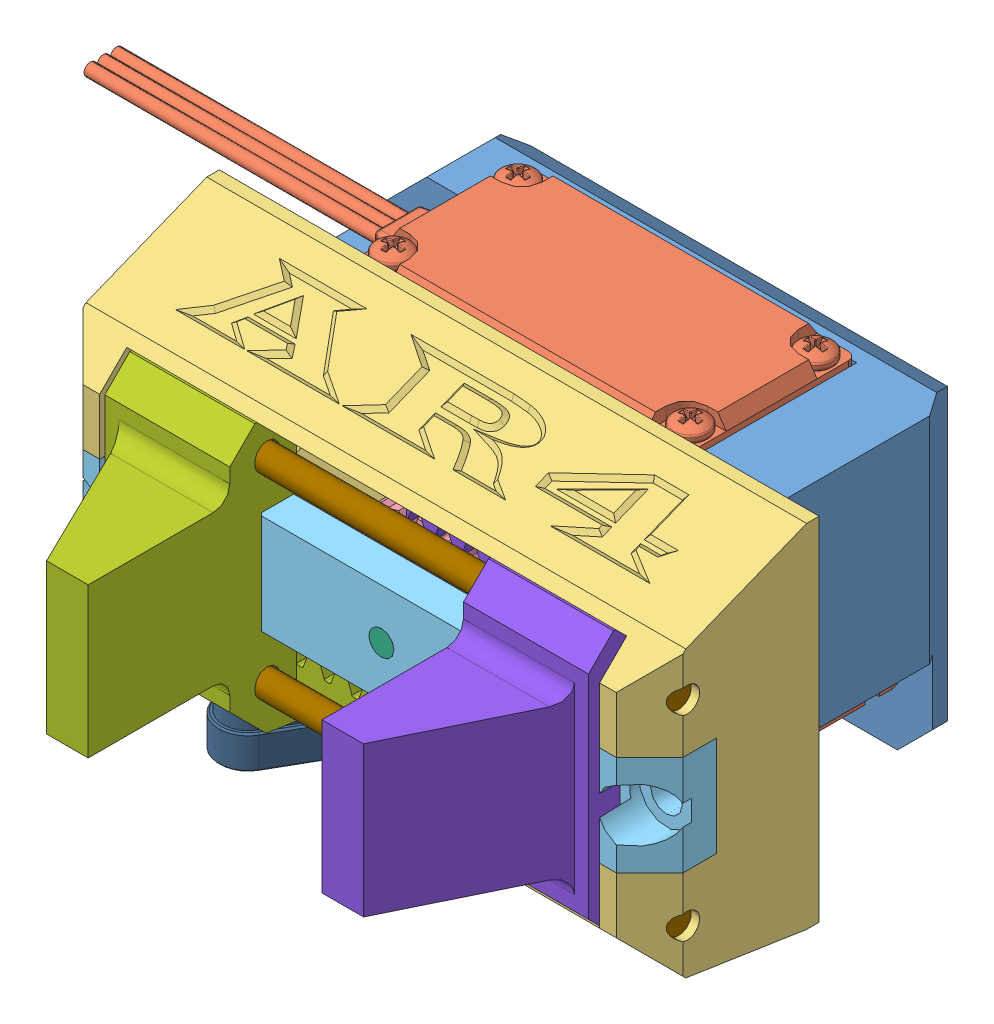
SolidWorks assembly AR4_SG1_assembly.SLDASM, configuration As Assembled (file format 14000). Lengths in mm.
Overall size (96.1 47.99 63.75).
12 component instances, 11 part files, 25 mates.
Components (placement in the parent):
- AR4_SG1_base-1: AR4_SG1_base.SLDPRT [Default] at origin size (60 37.8 26.4)
- Servo 25Kg-1: Servo 25Kg.SLDPRT [As Machined] at (-10 -25.8 16.2) x (1 0 0) z (0 -1 0) size (87.25 20.4 45.95)
- AR4_SG1_carriage-1: AR4_SG1_carriage.SLDPRT [Default] at (0 0 26.4) size (72 42.2 20.35)
- AR4_SG1_gear-1: AR4_SG1_gear.SLDPRT [As Machined] at (0 -2.9 33.3374) x (0 0 -1) z (0.954498 0.298217 0) size (6 21.08 20.96)
- AR4_SG1_center_bar-1: AR4_SG1_center_bar.SLDPRT [As Machined] at (0 -2.9 38.7321) size (72 12 8.02)
- AR4_SG1_16.5_gear_rod-1: AR4_SG1_16.5_gear_rod.SLDPRT [As Machined] at (0 -2.9 26.4321) size (3 3 16.5)
- AR4_SG1_jaw1-1: AR4_SG1_jaw1.SLDPRT [As Machined] at (-13.9495 -15.225 35.575) size (30.86 34.3 31.35)
- AR4_SG1_jaw2-1: AR4_SG1_jaw2.SLDPRT [As Machined] at (13.2379 9.925 35.575) x (-1 0 0) z (0 0 1) size (30.86 31.5 31.35)
- AR4_SG1_70mm_carriage_rod-1: AR4_SG1_70mm_carriage_rod.SLDPRT [As Machined] at (35 -14.65 42.25) x (0 0.998016 0.062962) z (-1 0 0) size (3 3 70)
- AR4_SG1_70mm_carriage_rod-2: AR4_SG1_70mm_carriage_rod.SLDPRT [As Machined] at (35 8.85 42.25) x (0 0.998016 0.062962) z (-1 0 0) size (3 3 70)
- Servo Arm-1: Servo Arm.SLDPRT [Défaut] at (-10 -21.8 16.2) x (0.495766 0 -0.868456) z (0 -1 0) size (34.98 15 6)
- M3x8 cap screw-1: M3x8 cap screw.SLDPRT [90751A111] at (-21.8984 -19.8 37.0429) x (0.926397 0 -0.376548) z (0 -1 0) size (5.5 5.5 11.18)
Mates (geometry in assembly coordinates):
- Concentric1: concentric anti-aligned: cylinder of Servo 25Kg-1 through (-24.8 -25.8 21.2) axis (0 1 0) radius 2.25; cylinder of AR4_SG1_base-1 through (-24.8 -2.5 21.2) axis (0 -1 0) radius 1.25
- Concentric2: concentric anti-aligned: cylinder of Servo 25Kg-1 through (24.8 -25.8 11.2) axis (0 1 0) radius 2.25; cylinder of AR4_SG1_base-1 through (24.8 -2.5 11.2) axis (0 -1 0) radius 1.25
- Coincident1: coincident anti-aligned: plane of AR4_SG1_base-1 through (-20.0887 -8 56.1024) normal (0 -1 0); plane of Servo 25Kg-1 through (-19.1 -8 25.4) normal (0 1 0)
- Concentric5: concentric anti-aligned: cylinder of AR4_SG1_gear-1 through (0 -2.9 32.4) axis (0 0 1) radius 1.5; cylinder of AR4_SG1_16.5_gear_rod-1 through (0 -2.9 42.9321) axis (0 0 -1) radius 1.5
- Coincident3: coincident anti-aligned: plane of AR4_SG1_carriage-1 through (0 0 32.4) normal (0 0 1); plane of AR4_SG1_gear-1 through (-4.1058 -1.4277 32.4) normal (0 0 -1)
- Concentric6: concentric aligned: cylinder of AR4_SG1_center_bar-1 through (-33 -2.9 38.7321) axis (0 0 1) radius 1.9; cylinder of AR4_SG1_carriage-1 through (-33 -2.9 31.7321) axis (0 0 1) radius 1.15
- Concentric7: concentric aligned: cylinder of AR4_SG1_center_bar-1 through (33 -2.9 38.7321) axis (0 0 1) radius 1.9; cylinder of AR4_SG1_carriage-1 through (33 -2.9 31.7321) axis (0 0 1) radius 1.15
- Coincident4: coincident anti-aligned: plane of AR4_SG1_carriage-1 through (-36 3.1 38.7321) normal (0 0 1); plane of AR4_SG1_center_bar-1 through (0 -2.9 38.7321) normal (0 0 -1)
- Concentric8: concentric anti-aligned: cylinder of AR4_SG1_center_bar-1 through (0 -2.9 38.7321) axis (0 0 1) radius 1.5; cylinder of AR4_SG1_gear_rod-1 through (0 -2.9 42.9321) axis (0 0 -1) radius 1.5
- Coincident5: coincident aligned: plane of AR4_SG1_center_bar-1 through (0 -2.9 42.9321) normal (0 0 1); plane of AR4_SG1_gear_rod-1 through (0 -2.9 42.9321) normal (0 0 1)
- Coincident7: coincident anti-aligned: plane of AR4_SG1_carriage-1 through (-30 13.1 107.1454) normal (0 -1 0); plane of AR4_SG1_jaw1-1 through (-29.38 13.1 63.75) normal (0 1 0)
- Coincident8: coincident anti-aligned: plane of AR4_SG1_carriage-1 through (0 0 32.4) normal (0 0 1); plane of AR4_SG1_jaw1-1 through (-0.4695 -14.2188 32.4) normal (0 0 -1)
- Coincident9: coincident anti-aligned: plane of AR4_SG1_carriage-1 through (0 0 32.4) normal (0 0 1); plane of AR4_SG1_jaw2-1 through (-0.2422 8.9188 32.4) normal (0 0 -1)
- Coincident10: coincident anti-aligned: plane of AR4_SG1_carriage-1 through (-30 13.1 107.1454) normal (0 -1 0); plane of AR4_SG1_jaw2-1 through (28.6684 13.1 32.4) normal (0 1 0)
- Concentric9: concentric aligned: cylinder of AR4_SG1_carriage-1 through (-36 -14.65 42.25) axis (1 0 0) radius 1.5; cylinder of AR4_SG1_70mm_carriage_rod-1 through (-35 -14.65 42.25) axis (1 0 0) radius 1.5
- Coincident11: coincident: point of AR4_SG1_carriage-1; unknown of AR4_SG1_70mm_carriage_rod-1
- Concentric11: concentric aligned: cylinder of AR4_SG1_70mm_carriage_rod-2 through (-35 8.85 42.25) axis (1 0 0) radius 1.5; cylinder of AR4_SG1_carriage-1 through (-36 8.85 42.25) axis (1 0 0) radius 1.5
- Coincident12: coincident: unknown of AR4_SG1_carriage-1; unknown of AR4_SG1_70mm_carriage_rod-2
- Concentric12: concentric anti-aligned: cylinder of Servo 25Kg-1 through (-10 -25.8 16.2) axis (0 -1 0) radius 1.25; cylinder of Servo Arm-1 through (-10 -27.8 16.2) axis (0 1 0) radius 1.65
- Coincident14: coincident anti-aligned: plane of Servo 25Kg-1 through (-10 -25.8 16.2) normal (0 -1 0); plane of Servo Arm-1 through (-10 -25.8 16.2) normal (0 1 0)
- Concentric13: concentric anti-aligned: cylinder of Servo Arm-1 through (-21.8984 -27.8 37.0429) axis (0 1 0) radius 1.5; circle of M3x8 cap screw-1
- Coincident15: coincident aligned: plane of Servo Arm-1 through (-21.8984 -27.8 37.0429) normal (0 -1 0); plane of M3x8 cap screw-1 through (-21.3336 -27.8 38.4325) normal (0 -1 0)
- Coincident16: coincident anti-aligned: plane of AR4_SG1_base-1 through (-20.1 65.0799 26.4) normal (0 0 1); plane of AR4_SG1_carriage-1 through (0 0 26.4) normal (0 0 -1)
- Concentric14: concentric aligned: cylinder of AR4_SG1_base-1 through (-27.5 -2 19.9) axis (0 0 1) radius 1.25; cylinder of AR4_SG1_carriage-1 through (-27.5 -2 26.4) axis (0 0 1) radius 1.75
- Concentric15: concentric aligned: cylinder of AR4_SG1_base-1 through (27.5 -2 19.9) axis (0 0 1) radius 1.25; cylinder of AR4_SG1_carriage-1 through (27.5 -2 26.4) axis (0 0 1) radius 1.75
